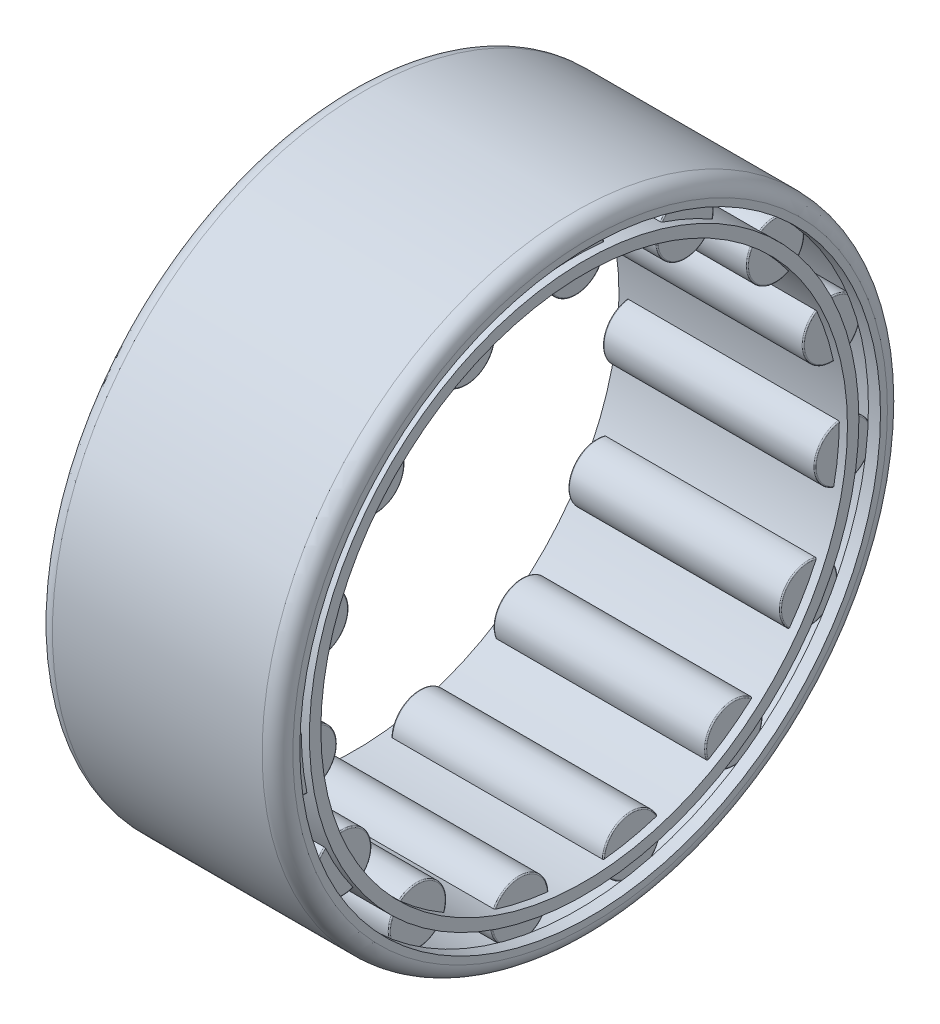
from build123d import *

# Parameters (mm, degrees)
CAGSPISKE_W           = 30.1625
CAGSPISKE_H           = 1.50642
ROLLERSDETAILED_COUNT = 15
ROLLERSDETAILED_ANGLE = 336


with BuildPart() as part:
    # InnRacSke → Race (revolve)
    with BuildSketch(Plane.XY, mode=Mode.PRIVATE) as race_sk:
        with BuildLine():
            Line((-14.2875, 38.3286), (-15.875, 38.3286))
            Line((-15.875, 38.3286), (-15.875, 39.243))
            ThreePointArc((-15.875, 39.243), (-15.279840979, 40.679840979), (-13.843, 41.275))
            Line((-13.843, 41.275), (13.843, 41.275))
            ThreePointArc((13.843, 41.275), (15.279840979, 40.679840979), (15.875, 39.243))
            Line((15.875, 39.243), (15.875, 38.3286))
            Line((15.875, 38.3286), (14.2875, 38.3286))
            Line((14.2875, 38.3286), (14.2875, 39.2811))
            Line((14.2875, 39.2811), (-14.2875, 39.2811))
            Line((-14.2875, 39.2811), (-14.2875, 38.3286))
        make_face()
    revolve(race_sk.sketch.rotate(Axis((-31.75, 0, 0), (1, 0, 0)), 270), axis=Axis((-31.75, 0, 0), (1, 0, 0)))

    # RolDetSke → RollerDetailed (revolve)
    with BuildSketch(Plane.XY, mode=Mode.PRIVATE) as rollerdetailed_sk:
        with BuildLine():
            Line((-14.00175, 39.130958), (-14.00175, 35.51555))
            Line((-14.00175, 35.51555), (14.00175, 35.51555))
            Line((14.00175, 35.51555), (14.00175, 39.130958))
            ThreePointArc((14.00175, 39.130958), (13.95762798, 39.23747798), (13.851108, 39.2816))
            Line((13.851108, 39.2816), (-13.851108, 39.2816))
            ThreePointArc((-13.851108, 39.2816), (-13.95762798, 39.23747798), (-14.00175, 39.130958))
        make_face()
    rollerdetailed = revolve(rollerdetailed_sk.sketch.rotate(Axis((-28.575, 35.51555, 0), (1, 0, 0)), 270), axis=Axis((-28.575, 35.51555, 0), (1, 0, 0)))

    # CagSpiSke → CageSpine (revolve)
    with BuildSketch(Plane.XY, mode=Mode.PRIVATE) as cagespine_sk:
        with Locations((0, 35.51555)):
            Rectangle(CAGSPISKE_W, CAGSPISKE_H)
    revolve(cagespine_sk.sketch.rotate(Axis((-31.75, 0, 0), (1, 0, 0)), 270), axis=Axis((-31.75, 0, 0), (1, 0, 0)))

    # RollersDetailed: RollerDetailed ×15 about axis
    rollersdetailed_axis = Axis((-50, 0, 0), (1, 0, 0))
    for i in range(1, ROLLERSDETAILED_COUNT):
        add(rollerdetailed.rotate(rollersdetailed_axis, i * ROLLERSDETAILED_ANGLE / (ROLLERSDETAILED_COUNT - 1)))


solid = part.part
